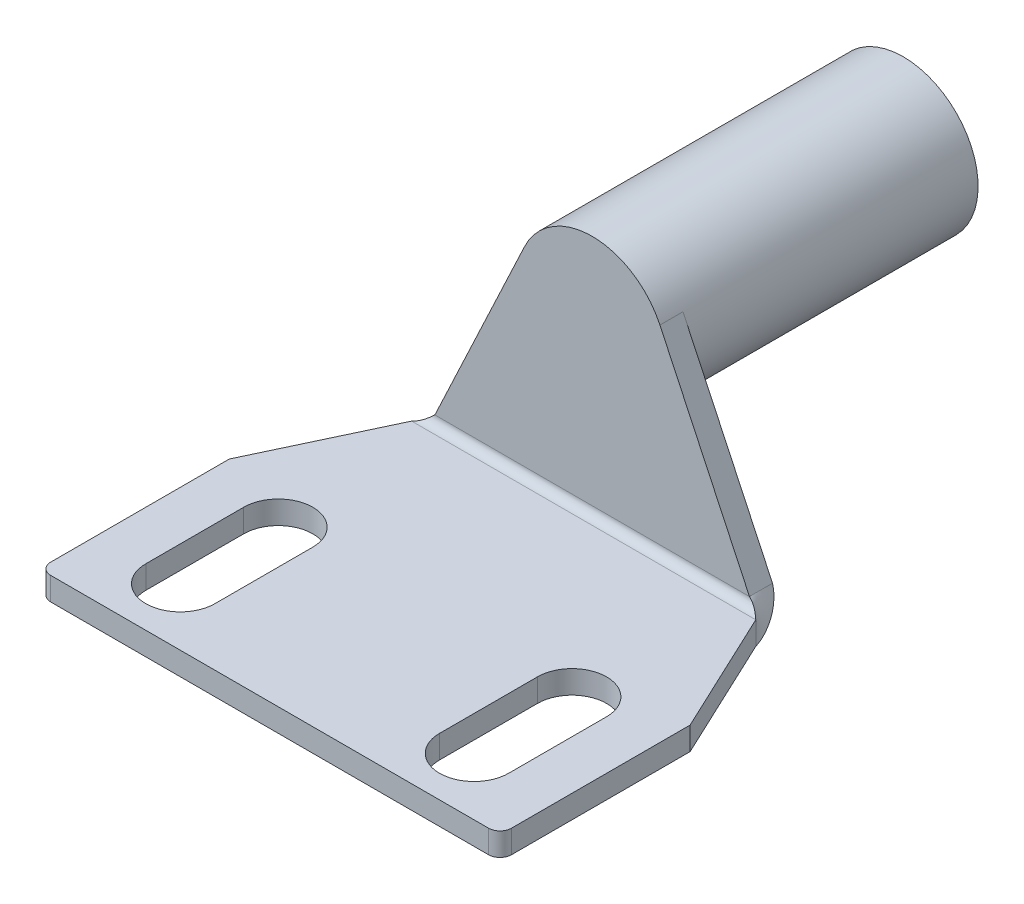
ISO-10303-21;
HEADER;
FILE_DESCRIPTION(('STEP AP214'),'2;1');
FILE_NAME('part.step','',(''),(''),'','','');
FILE_SCHEMA(('AUTOMOTIVE_DESIGN { 1 0 10303 214 1 1 1 1 }'));
ENDSEC;
DATA;
#1=APPLICATION_CONTEXT('core data for automotive mechanical design processes');
#2=APPLICATION_PROTOCOL_DEFINITION('international standard','automotive_design',2000,#1);
#3=PRODUCT_CONTEXT('',#1,'mechanical');
#4=PRODUCT('Part','Part','',(#3));
#5=PRODUCT_RELATED_PRODUCT_CATEGORY('part','',(#4));
#6=PRODUCT_DEFINITION_FORMATION('','',#4);
#7=PRODUCT_DEFINITION_CONTEXT('part definition',#1,'design');
#8=PRODUCT_DEFINITION('design','',#6,#7);
#9=PRODUCT_DEFINITION_SHAPE('','',#8);
#10=(LENGTH_UNIT() NAMED_UNIT(*) SI_UNIT(.MILLI.,.METRE.));
#11=(NAMED_UNIT(*) PLANE_ANGLE_UNIT() SI_UNIT($,.RADIAN.));
#12=(NAMED_UNIT(*) SI_UNIT($,.STERADIAN.) SOLID_ANGLE_UNIT());
#13=UNCERTAINTY_MEASURE_WITH_UNIT(LENGTH_MEASURE(1.E-05),#10,'distance_accuracy_value','');
#14=(GEOMETRIC_REPRESENTATION_CONTEXT(3) GLOBAL_UNCERTAINTY_ASSIGNED_CONTEXT((#13)) GLOBAL_UNIT_ASSIGNED_CONTEXT((#10,
#11,#12)) REPRESENTATION_CONTEXT('',''));
#15=CARTESIAN_POINT('',(0.,0.,0.));
#16=DIRECTION('',(0.,0.,1.));
#17=DIRECTION('',(1.,0.,0.));
#18=AXIS2_PLACEMENT_3D('',#15,#16,#17);
#19=CARTESIAN_POINT('',(-20.,-2.,0.));
#20=DIRECTION('',(-1.,0.,0.));
#21=DIRECTION('',(0.,0.,1.));
#22=AXIS2_PLACEMENT_3D('',#19,#20,#21);
#23=PLANE('',#22);
#24=DIRECTION('',(0.,0.,1.));
#25=VECTOR('',#24,1.);
#26=CARTESIAN_POINT('',(-20.,-2.,0.));
#27=LINE('',#26,#25);
#28=CARTESIAN_POINT('',(-20.,-2.,-18.5));
#29=VERTEX_POINT('',#28);
#30=CARTESIAN_POINT('',(-20.,-2.,-3.));
#31=VERTEX_POINT('',#30);
#32=EDGE_CURVE('E426',#29,#31,#27,.T.);
#33=ORIENTED_EDGE('',*,*,#32,.T.);
#34=DIRECTION('',(0.,1.,0.));
#35=VECTOR('',#34,1.);
#36=CARTESIAN_POINT('',(-20.,-2.,-3.));
#37=LINE('',#36,#35);
#38=CARTESIAN_POINT('',(-20.,0.,-3.));
#39=VERTEX_POINT('',#38);
#40=EDGE_CURVE('E552',#31,#39,#37,.T.);
#41=ORIENTED_EDGE('',*,*,#40,.T.);
#42=DIRECTION('',(0.,0.,1.));
#43=VECTOR('',#42,1.);
#44=CARTESIAN_POINT('',(-20.,0.,0.));
#45=LINE('',#44,#43);
#46=CARTESIAN_POINT('',(-20.,0.,-18.5));
#47=VERTEX_POINT('',#46);
#48=EDGE_CURVE('E416',#47,#39,#45,.T.);
#49=ORIENTED_EDGE('',*,*,#48,.F.);
#50=DIRECTION('',(0.,1.,0.));
#51=VECTOR('',#50,1.);
#52=CARTESIAN_POINT('',(-20.,-2.,-18.5));
#53=LINE('',#52,#51);
#54=EDGE_CURVE('E404',#29,#47,#53,.T.);
#55=ORIENTED_EDGE('',*,*,#54,.F.);
#56=EDGE_LOOP('',(#33,#41,#49,#55));
#57=FACE_BOUND('',#56,.T.);
#58=ADVANCED_FACE('F69',(#57),#23,.T.);
#59=CARTESIAN_POINT('',(20.,-2.,0.));
#60=DIRECTION('',(1.,0.,0.));
#61=DIRECTION('',(0.,0.,-1.));
#62=AXIS2_PLACEMENT_3D('',#59,#60,#61);
#63=PLANE('',#62);
#64=DIRECTION('',(0.,0.,-1.));
#65=VECTOR('',#64,1.);
#66=CARTESIAN_POINT('',(20.,0.,0.));
#67=LINE('',#66,#65);
#68=CARTESIAN_POINT('',(20.,0.,-3.));
#69=VERTEX_POINT('',#68);
#70=CARTESIAN_POINT('',(20.,0.,-18.5));
#71=VERTEX_POINT('',#70);
#72=EDGE_CURVE('E414',#69,#71,#67,.T.);
#73=ORIENTED_EDGE('',*,*,#72,.F.);
#74=DIRECTION('',(0.,-1.,0.));
#75=VECTOR('',#74,1.);
#76=CARTESIAN_POINT('',(20.,-2.,-3.));
#77=LINE('',#76,#75);
#78=CARTESIAN_POINT('',(20.,-2.,-3.));
#79=VERTEX_POINT('',#78);
#80=EDGE_CURVE('E12',#69,#79,#77,.T.);
#81=ORIENTED_EDGE('',*,*,#80,.T.);
#82=DIRECTION('',(0.,0.,-1.));
#83=VECTOR('',#82,1.);
#84=CARTESIAN_POINT('',(20.,-2.,0.));
#85=LINE('',#84,#83);
#86=CARTESIAN_POINT('',(20.,-2.,-18.5));
#87=VERTEX_POINT('',#86);
#88=EDGE_CURVE('E424',#79,#87,#85,.T.);
#89=ORIENTED_EDGE('',*,*,#88,.T.);
#90=DIRECTION('',(0.,1.,0.));
#91=VECTOR('',#90,1.);
#92=CARTESIAN_POINT('',(20.,-2.,-18.5));
#93=LINE('',#92,#91);
#94=EDGE_CURVE('E420',#87,#71,#93,.T.);
#95=ORIENTED_EDGE('',*,*,#94,.T.);
#96=EDGE_LOOP('',(#73,#81,#89,#95));
#97=FACE_BOUND('',#96,.T.);
#98=ADVANCED_FACE('F578',(#97),#63,.T.);
#99=CARTESIAN_POINT('',(0.,-2.,-45.75));
#100=DIRECTION('',(0.,1.,0.));
#101=DIRECTION('',(0.,0.,1.));
#102=AXIS2_PLACEMENT_3D('',#99,#100,#101);
#103=PLANE('',#102);
#104=DIRECTION('',(0.,0.,1.));
#105=VECTOR('',#104,1.);
#106=CARTESIAN_POINT('',(-15.75,-2.,-45.75));
#107=LINE('',#106,#105);
#108=CARTESIAN_POINT('',(-15.75,-2.,-15.5));
#109=VERTEX_POINT('',#108);
#110=CARTESIAN_POINT('',(-15.75,-2.,-7.));
#111=VERTEX_POINT('',#110);
#112=EDGE_CURVE('E268',#109,#111,#107,.T.);
#113=ORIENTED_EDGE('',*,*,#112,.T.);
#114=CARTESIAN_POINT('',(-12.75,-2.,-7.));
#115=DIRECTION('',(0.,1.,0.));
#116=DIRECTION('',(0.,0.,1.));
#117=AXIS2_PLACEMENT_3D('',#114,#115,#116);
#118=CIRCLE('',#117,3.);
#119=CARTESIAN_POINT('',(-9.75,-2.,-7.));
#120=VERTEX_POINT('',#119);
#121=EDGE_CURVE('E271',#111,#120,#118,.T.);
#122=ORIENTED_EDGE('',*,*,#121,.T.);
#123=DIRECTION('',(0.,0.,-1.));
#124=VECTOR('',#123,1.);
#125=CARTESIAN_POINT('',(-9.74999999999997,-2.,-45.75));
#126=LINE('',#125,#124);
#127=CARTESIAN_POINT('',(-9.74999999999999,-2.,-15.5));
#128=VERTEX_POINT('',#127);
#129=EDGE_CURVE('E239',#120,#128,#126,.T.);
#130=ORIENTED_EDGE('',*,*,#129,.T.);
#131=CARTESIAN_POINT('',(-12.75,-2.,-15.5));
#132=DIRECTION('',(0.,1.,0.));
#133=DIRECTION('',(0.,0.,1.));
#134=AXIS2_PLACEMENT_3D('',#131,#132,#133);
#135=CIRCLE('',#134,3.);
#136=EDGE_CURVE('E265',#128,#109,#135,.T.);
#137=ORIENTED_EDGE('',*,*,#136,.T.);
#138=EDGE_LOOP('',(#113,#122,#130,#137));
#139=FACE_BOUND('',#138,.T.);
#140=DIRECTION('',(0.,0.,1.));
#141=VECTOR('',#140,1.);
#142=CARTESIAN_POINT('',(9.74999999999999,-2.,-45.75));
#143=LINE('',#142,#141);
#144=CARTESIAN_POINT('',(9.75,-2.,-15.5));
#145=VERTEX_POINT('',#144);
#146=CARTESIAN_POINT('',(9.75,-2.,-7.));
#147=VERTEX_POINT('',#146);
#148=EDGE_CURVE('E277',#145,#147,#143,.T.);
#149=ORIENTED_EDGE('',*,*,#148,.T.);
#150=CARTESIAN_POINT('',(12.75,-2.,-7.));
#151=DIRECTION('',(0.,1.,0.));
#152=DIRECTION('',(0.,0.,1.));
#153=AXIS2_PLACEMENT_3D('',#150,#151,#152);
#154=CIRCLE('',#153,3.);
#155=CARTESIAN_POINT('',(15.75,-2.,-7.));
#156=VERTEX_POINT('',#155);
#157=EDGE_CURVE('E280',#147,#156,#154,.T.);
#158=ORIENTED_EDGE('',*,*,#157,.T.);
#159=DIRECTION('',(0.,0.,-1.));
#160=VECTOR('',#159,1.);
#161=CARTESIAN_POINT('',(15.75,-2.,-45.75));
#162=LINE('',#161,#160);
#163=CARTESIAN_POINT('',(15.75,-2.,-15.5));
#164=VERTEX_POINT('',#163);
#165=EDGE_CURVE('E274',#156,#164,#162,.T.);
#166=ORIENTED_EDGE('',*,*,#165,.T.);
#167=CARTESIAN_POINT('',(12.75,-2.,-15.5));
#168=DIRECTION('',(0.,1.,0.));
#169=DIRECTION('',(0.,0.,1.));
#170=AXIS2_PLACEMENT_3D('',#167,#168,#169);
#171=CIRCLE('',#170,3.);
#172=EDGE_CURVE('E214',#164,#145,#171,.T.);
#173=ORIENTED_EDGE('',*,*,#172,.T.);
#174=EDGE_LOOP('',(#149,#158,#166,#173));
#175=FACE_BOUND('',#174,.T.);
#176=DIRECTION('',(1.,0.,0.));
#177=VECTOR('',#176,1.);
#178=CARTESIAN_POINT('',(0.,-2.,-2.));
#179=LINE('',#178,#177);
#180=CARTESIAN_POINT('',(-19.,-2.,-2.));
#181=VERTEX_POINT('',#180);
#182=CARTESIAN_POINT('',(19.,-2.,-2.));
#183=VERTEX_POINT('',#182);
#184=EDGE_CURVE('E245',#181,#183,#179,.T.);
#185=ORIENTED_EDGE('',*,*,#184,.F.);
#186=CARTESIAN_POINT('',(-19.,-2.,-3.));
#187=DIRECTION('',(0.,1.,0.));
#188=DIRECTION('',(0.,0.,1.));
#189=AXIS2_PLACEMENT_3D('',#186,#187,#188);
#190=CIRCLE('',#189,1.);
#191=EDGE_CURVE('E77',#181,#31,#190,.F.);
#192=ORIENTED_EDGE('',*,*,#191,.T.);
#193=ORIENTED_EDGE('',*,*,#32,.F.);
#194=DIRECTION('',(-0.42561713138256,0.,0.904903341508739));
#195=VECTOR('',#194,1.);
#196=CARTESIAN_POINT('',(-20.,-2.,-18.5));
#197=LINE('',#196,#195);
#198=CARTESIAN_POINT('',(-14.9374842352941,-2.,-29.2634));
#199=VERTEX_POINT('',#198);
#200=EDGE_CURVE('E413',#199,#29,#197,.T.);
#201=ORIENTED_EDGE('',*,*,#200,.F.);
#202=DIRECTION('',(-1.,0.,0.));
#203=VECTOR('',#202,1.);
#204=CARTESIAN_POINT('',(0.,-2.,-29.2634));
#205=LINE('',#204,#203);
#206=CARTESIAN_POINT('',(14.9374842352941,-2.,-29.2634));
#207=VERTEX_POINT('',#206);
#208=EDGE_CURVE('E429',#207,#199,#205,.T.);
#209=ORIENTED_EDGE('',*,*,#208,.F.);
#210=DIRECTION('',(-0.42561713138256,0.,-0.904903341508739));
#211=VECTOR('',#210,1.);
#212=CARTESIAN_POINT('',(20.,-2.,-18.5));
#213=LINE('',#212,#211);
#214=EDGE_CURVE('E423',#87,#207,#213,.T.);
#215=ORIENTED_EDGE('',*,*,#214,.F.);
#216=ORIENTED_EDGE('',*,*,#88,.F.);
#217=CARTESIAN_POINT('',(19.,-2.,-3.));
#218=DIRECTION('',(0.,1.,0.));
#219=DIRECTION('',(0.,0.,1.));
#220=AXIS2_PLACEMENT_3D('',#217,#218,#219);
#221=CIRCLE('',#220,1.);
#222=EDGE_CURVE('E84',#79,#183,#221,.F.);
#223=ORIENTED_EDGE('',*,*,#222,.T.);
#224=EDGE_LOOP('',(#185,#192,#193,#201,#209,#215,#216,#223));
#225=FACE_BOUND('',#224,.T.);
#226=ADVANCED_FACE('F463',(#139,#175,#225),#103,.F.);
#227=CARTESIAN_POINT('',(0.,0.,-45.75));
#228=DIRECTION('',(0.,1.,0.));
#229=DIRECTION('',(0.,0.,1.));
#230=AXIS2_PLACEMENT_3D('',#227,#228,#229);
#231=PLANE('',#230);
#232=CARTESIAN_POINT('',(12.75,0.,-7.));
#233=DIRECTION('',(0.,1.,0.));
#234=DIRECTION('',(0.,0.,1.));
#235=AXIS2_PLACEMENT_3D('',#232,#233,#234);
#236=CIRCLE('',#235,3.);
#237=CARTESIAN_POINT('',(9.75,0.,-7.));
#238=VERTEX_POINT('',#237);
#239=CARTESIAN_POINT('',(15.75,0.,-7.));
#240=VERTEX_POINT('',#239);
#241=EDGE_CURVE('E227',#238,#240,#236,.T.);
#242=ORIENTED_EDGE('',*,*,#241,.F.);
#243=DIRECTION('',(0.,0.,1.));
#244=VECTOR('',#243,1.);
#245=CARTESIAN_POINT('',(9.75,0.,-7.));
#246=LINE('',#245,#244);
#247=CARTESIAN_POINT('',(9.75,0.,-15.5));
#248=VERTEX_POINT('',#247);
#249=EDGE_CURVE('E232',#248,#238,#246,.T.);
#250=ORIENTED_EDGE('',*,*,#249,.F.);
#251=CARTESIAN_POINT('',(12.75,0.,-15.5));
#252=DIRECTION('',(0.,1.,0.));
#253=DIRECTION('',(0.,0.,1.));
#254=AXIS2_PLACEMENT_3D('',#251,#252,#253);
#255=CIRCLE('',#254,3.);
#256=CARTESIAN_POINT('',(15.75,0.,-15.5));
#257=VERTEX_POINT('',#256);
#258=EDGE_CURVE('E211',#257,#248,#255,.T.);
#259=ORIENTED_EDGE('',*,*,#258,.F.);
#260=DIRECTION('',(0.,0.,-1.));
#261=VECTOR('',#260,1.);
#262=CARTESIAN_POINT('',(15.75,0.,-7.));
#263=LINE('',#262,#261);
#264=EDGE_CURVE('E222',#240,#257,#263,.T.);
#265=ORIENTED_EDGE('',*,*,#264,.F.);
#266=EDGE_LOOP('',(#242,#250,#259,#265));
#267=FACE_BOUND('',#266,.T.);
#268=CARTESIAN_POINT('',(-12.75,0.,-7.));
#269=DIRECTION('',(0.,1.,0.));
#270=DIRECTION('',(0.,0.,-1.));
#271=AXIS2_PLACEMENT_3D('',#268,#269,#270);
#272=CIRCLE('',#271,3.);
#273=CARTESIAN_POINT('',(-15.75,0.,-7.));
#274=VERTEX_POINT('',#273);
#275=CARTESIAN_POINT('',(-9.75,0.,-7.00000000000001));
#276=VERTEX_POINT('',#275);
#277=EDGE_CURVE('E242',#274,#276,#272,.T.);
#278=ORIENTED_EDGE('',*,*,#277,.F.);
#279=DIRECTION('',(0.,0.,1.));
#280=VECTOR('',#279,1.);
#281=CARTESIAN_POINT('',(-15.75,0.,-7.));
#282=LINE('',#281,#280);
#283=CARTESIAN_POINT('',(-15.75,0.,-15.5));
#284=VERTEX_POINT('',#283);
#285=EDGE_CURVE('E251',#284,#274,#282,.T.);
#286=ORIENTED_EDGE('',*,*,#285,.F.);
#287=CARTESIAN_POINT('',(-12.75,0.,-15.5));
#288=DIRECTION('',(0.,1.,0.));
#289=DIRECTION('',(0.,0.,-1.));
#290=AXIS2_PLACEMENT_3D('',#287,#288,#289);
#291=CIRCLE('',#290,3.);
#292=CARTESIAN_POINT('',(-9.74999999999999,0.,-15.5));
#293=VERTEX_POINT('',#292);
#294=EDGE_CURVE('E248',#293,#284,#291,.T.);
#295=ORIENTED_EDGE('',*,*,#294,.F.);
#296=DIRECTION('',(0.,0.,-1.));
#297=VECTOR('',#296,1.);
#298=CARTESIAN_POINT('',(-9.75,0.,-7.));
#299=LINE('',#298,#297);
#300=EDGE_CURVE('E244',#276,#293,#299,.T.);
#301=ORIENTED_EDGE('',*,*,#300,.F.);
#302=EDGE_LOOP('',(#278,#286,#295,#301));
#303=FACE_BOUND('',#302,.T.);
#304=ORIENTED_EDGE('',*,*,#48,.T.);
#305=CARTESIAN_POINT('',(-19.,0.,-3.));
#306=DIRECTION('',(0.,1.,0.));
#307=DIRECTION('',(0.,0.,1.));
#308=AXIS2_PLACEMENT_3D('',#305,#306,#307);
#309=CIRCLE('',#308,1.);
#310=CARTESIAN_POINT('',(-19.,0.,-2.));
#311=VERTEX_POINT('',#310);
#312=EDGE_CURVE('E557',#39,#311,#309,.T.);
#313=ORIENTED_EDGE('',*,*,#312,.T.);
#314=DIRECTION('',(1.,0.,0.));
#315=VECTOR('',#314,1.);
#316=CARTESIAN_POINT('',(0.,0.,-2.));
#317=LINE('',#316,#315);
#318=CARTESIAN_POINT('',(19.,0.,-2.));
#319=VERTEX_POINT('',#318);
#320=EDGE_CURVE('E290',#311,#319,#317,.T.);
#321=ORIENTED_EDGE('',*,*,#320,.T.);
#322=CARTESIAN_POINT('',(19.,0.,-3.));
#323=DIRECTION('',(0.,1.,0.));
#324=DIRECTION('',(0.,0.,1.));
#325=AXIS2_PLACEMENT_3D('',#322,#323,#324);
#326=CIRCLE('',#325,1.);
#327=EDGE_CURVE('E555',#319,#69,#326,.T.);
#328=ORIENTED_EDGE('',*,*,#327,.T.);
#329=ORIENTED_EDGE('',*,*,#72,.T.);
#330=DIRECTION('',(-0.42561713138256,0.,-0.904903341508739));
#331=VECTOR('',#330,1.);
#332=CARTESIAN_POINT('',(20.,0.,-18.5));
#333=LINE('',#332,#331);
#334=CARTESIAN_POINT('',(14.9374842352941,0.,-29.2634));
#335=VERTEX_POINT('',#334);
#336=EDGE_CURVE('E433',#71,#335,#333,.T.);
#337=ORIENTED_EDGE('',*,*,#336,.T.);
#338=DIRECTION('',(-1.,0.,0.));
#339=VECTOR('',#338,1.);
#340=CARTESIAN_POINT('',(0.,0.,-29.2634));
#341=LINE('',#340,#339);
#342=CARTESIAN_POINT('',(-14.9374842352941,0.,-29.2634));
#343=VERTEX_POINT('',#342);
#344=EDGE_CURVE('E430',#335,#343,#341,.T.);
#345=ORIENTED_EDGE('',*,*,#344,.T.);
#346=DIRECTION('',(-0.42561713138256,0.,0.904903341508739));
#347=VECTOR('',#346,1.);
#348=CARTESIAN_POINT('',(-20.,0.,-18.5));
#349=LINE('',#348,#347);
#350=EDGE_CURVE('E419',#343,#47,#349,.T.);
#351=ORIENTED_EDGE('',*,*,#350,.T.);
#352=EDGE_LOOP('',(#304,#313,#321,#328,#329,#337,#345,#351));
#353=FACE_BOUND('',#352,.T.);
#354=ADVANCED_FACE('F229',(#267,#303,#353),#231,.T.);
#355=CARTESIAN_POINT('',(0.,14.495355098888,-32.));
#356=DIRECTION('',(0.,0.,1.));
#357=DIRECTION('',(0.,-1.,0.));
#358=AXIS2_PLACEMENT_3D('',#355,#356,#357);
#359=PLANE('',#358);
#360=CARTESIAN_POINT('',(0.,14.495355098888,-32.));
#361=DIRECTION('',(0.,0.,-1.));
#362=DIRECTION('',(0.,1.,0.));
#363=AXIS2_PLACEMENT_3D('',#360,#361,#362);
#364=CIRCLE('',#363,6.5);
#365=CARTESIAN_POINT('',(5.88187171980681,17.2618664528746,-32.));
#366=VERTEX_POINT('',#365);
#367=CARTESIAN_POINT('',(-5.8818717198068,17.2618664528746,-32.));
#368=VERTEX_POINT('',#367);
#369=EDGE_CURVE('E286',#366,#368,#364,.T.);
#370=ORIENTED_EDGE('',*,*,#369,.F.);
#371=DIRECTION('',(-0.42561713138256,0.904903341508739,0.));
#372=VECTOR('',#371,1.);
#373=CARTESIAN_POINT('',(20.,-12.754644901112,-32.0000000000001));
#374=LINE('',#373,#372);
#375=CARTESIAN_POINT('',(13.6544549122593,0.736600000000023,-32.));
#376=VERTEX_POINT('',#375);
#377=EDGE_CURVE('E505',#376,#366,#374,.T.);
#378=ORIENTED_EDGE('',*,*,#377,.F.);
#379=DIRECTION('',(-1.,0.,0.));
#380=VECTOR('',#379,1.);
#381=CARTESIAN_POINT('',(0.,0.736600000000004,-32.));
#382=LINE('',#381,#380);
#383=CARTESIAN_POINT('',(-13.6544549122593,0.736600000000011,-32.));
#384=VERTEX_POINT('',#383);
#385=EDGE_CURVE('E493',#376,#384,#382,.T.);
#386=ORIENTED_EDGE('',*,*,#385,.T.);
#387=DIRECTION('',(-0.42561713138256,-0.904903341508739,0.));
#388=VECTOR('',#387,1.);
#389=CARTESIAN_POINT('',(-20.,-12.754644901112,-32.0000000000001));
#390=LINE('',#389,#388);
#391=EDGE_CURVE('E497',#368,#384,#390,.T.);
#392=ORIENTED_EDGE('',*,*,#391,.F.);
#393=EDGE_LOOP('',(#370,#378,#386,#392));
#394=FACE_BOUND('',#393,.T.);
#395=ADVANCED_FACE('F466',(#394),#359,.F.);
#396=CARTESIAN_POINT('',(-20.,-12.754644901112,-32.0000000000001));
#397=DIRECTION('',(-0.904903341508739,0.42561713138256,0.));
#398=DIRECTION('',(-0.42561713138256,-0.904903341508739,0.));
#399=AXIS2_PLACEMENT_3D('',#396,#397,#398);
#400=PLANE('',#399);
#401=CARTESIAN_POINT('',(-13.6544549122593,0.7366,-30.));
#402=CARTESIAN_POINT('',(-13.6544549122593,0.736599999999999,-32.));
#403=B_SPLINE_CURVE_WITH_KNOTS('',1,(#401,#402),.UNSPECIFIED.,.F.,.F.,(2,2),(0.,1.),.UNSPECIFIED.);
#404=CARTESIAN_POINT('',(-13.6544549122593,0.736600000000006,-30.));
#405=VERTEX_POINT('',#404);
#406=EDGE_CURVE('E291',#405,#384,#403,.T.);
#407=ORIENTED_EDGE('',*,*,#406,.F.);
#408=DIRECTION('',(-0.42561713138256,-0.904903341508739,0.));
#409=VECTOR('',#408,1.);
#410=CARTESIAN_POINT('',(-20.,-12.754644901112,-30.0000000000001));
#411=LINE('',#410,#409);
#412=CARTESIAN_POINT('',(-5.8818717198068,17.2618664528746,-30.));
#413=VERTEX_POINT('',#412);
#414=EDGE_CURVE('E490',#413,#405,#411,.T.);
#415=ORIENTED_EDGE('',*,*,#414,.F.);
#416=DIRECTION('',(0.,0.,1.));
#417=VECTOR('',#416,1.);
#418=CARTESIAN_POINT('',(-5.8818717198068,17.2618664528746,-32.));
#419=LINE('',#418,#417);
#420=EDGE_CURVE('E491',#368,#413,#419,.T.);
#421=ORIENTED_EDGE('',*,*,#420,.F.);
#422=ORIENTED_EDGE('',*,*,#391,.T.);
#423=EDGE_LOOP('',(#407,#415,#421,#422));
#424=FACE_BOUND('',#423,.T.);
#425=ADVANCED_FACE('F533',(#424),#400,.T.);
#426=CARTESIAN_POINT('',(0.,14.495355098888,-32.));
#427=DIRECTION('',(0.,0.,1.));
#428=DIRECTION('',(0.,-1.,0.));
#429=AXIS2_PLACEMENT_3D('',#426,#427,#428);
#430=CYLINDRICAL_SURFACE('',#429,6.50000000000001);
#431=CARTESIAN_POINT('',(0.,14.495355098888,-30.));
#432=DIRECTION('',(0.,0.,1.));
#433=DIRECTION('',(0.,-1.,0.));
#434=AXIS2_PLACEMENT_3D('',#431,#432,#433);
#435=CIRCLE('',#434,6.50000000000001);
#436=CARTESIAN_POINT('',(5.8818717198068,17.2618664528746,-30.));
#437=VERTEX_POINT('',#436);
#438=EDGE_CURVE('E487',#437,#413,#435,.T.);
#439=ORIENTED_EDGE('',*,*,#438,.F.);
#440=DIRECTION('',(0.,0.,1.));
#441=VECTOR('',#440,1.);
#442=CARTESIAN_POINT('',(5.8818717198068,17.2618664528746,-32.));
#443=LINE('',#442,#441);
#444=EDGE_CURVE('E494',#366,#437,#443,.T.);
#445=ORIENTED_EDGE('',*,*,#444,.F.);
#446=ORIENTED_EDGE('',*,*,#369,.T.);
#447=ORIENTED_EDGE('',*,*,#420,.T.);
#448=EDGE_LOOP('',(#439,#445,#446,#447));
#449=FACE_BOUND('',#448,.T.);
#450=CARTESIAN_POINT('',(0.,14.4953550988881,-57.));
#451=DIRECTION('',(0.,0.,-1.));
#452=DIRECTION('',(0.,1.,0.));
#453=AXIS2_PLACEMENT_3D('',#450,#451,#452);
#454=CIRCLE('',#453,6.5);
#455=CARTESIAN_POINT('',(0.,20.9953550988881,-56.9999999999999));
#456=VERTEX_POINT('',#455);
#457=EDGE_CURVE('E292',#456,#456,#454,.T.);
#458=ORIENTED_EDGE('',*,*,#457,.F.);
#459=EDGE_LOOP('',(#458));
#460=FACE_BOUND('',#459,.T.);
#461=ADVANCED_FACE('F471',(#449,#460),#430,.T.);
#462=CARTESIAN_POINT('',(20.,-12.754644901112,-32.0000000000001));
#463=DIRECTION('',(0.904903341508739,0.42561713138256,0.));
#464=DIRECTION('',(-0.42561713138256,0.904903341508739,0.));
#465=AXIS2_PLACEMENT_3D('',#462,#463,#464);
#466=PLANE('',#465);
#467=CARTESIAN_POINT('',(13.6544549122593,0.736599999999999,-32.));
#468=CARTESIAN_POINT('',(13.6544549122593,0.7366,-30.));
#469=B_SPLINE_CURVE_WITH_KNOTS('',1,(#467,#468),.UNSPECIFIED.,.F.,.F.,(2,2),(0.,1.),.UNSPECIFIED.);
#470=CARTESIAN_POINT('',(13.6544549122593,0.736600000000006,-30.));
#471=VERTEX_POINT('',#470);
#472=EDGE_CURVE('E500',#376,#471,#469,.T.);
#473=ORIENTED_EDGE('',*,*,#472,.F.);
#474=ORIENTED_EDGE('',*,*,#377,.T.);
#475=ORIENTED_EDGE('',*,*,#444,.T.);
#476=DIRECTION('',(-0.42561713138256,0.904903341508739,0.));
#477=VECTOR('',#476,1.);
#478=CARTESIAN_POINT('',(20.,-12.754644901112,-30.0000000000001));
#479=LINE('',#478,#477);
#480=EDGE_CURVE('E412',#471,#437,#479,.T.);
#481=ORIENTED_EDGE('',*,*,#480,.F.);
#482=EDGE_LOOP('',(#473,#474,#475,#481));
#483=FACE_BOUND('',#482,.T.);
#484=ADVANCED_FACE('F521',(#483),#466,.T.);
#485=CARTESIAN_POINT('',(0.,14.495355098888,-30.));
#486=DIRECTION('',(0.,0.,1.));
#487=DIRECTION('',(0.,-1.,0.));
#488=AXIS2_PLACEMENT_3D('',#485,#486,#487);
#489=PLANE('',#488);
#490=DIRECTION('',(-1.,0.,0.));
#491=VECTOR('',#490,1.);
#492=CARTESIAN_POINT('',(0.,0.736599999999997,-30.));
#493=LINE('',#492,#491);
#494=EDGE_CURVE('E583',#471,#405,#493,.T.);
#495=ORIENTED_EDGE('',*,*,#494,.F.);
#496=ORIENTED_EDGE('',*,*,#480,.T.);
#497=ORIENTED_EDGE('',*,*,#438,.T.);
#498=ORIENTED_EDGE('',*,*,#414,.T.);
#499=EDGE_LOOP('',(#495,#496,#497,#498));
#500=FACE_BOUND('',#499,.T.);
#501=ADVANCED_FACE('F462',(#500),#489,.T.);
#502=CARTESIAN_POINT('',(20.,-2.,-18.5));
#503=DIRECTION('',(0.904903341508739,0.,-0.42561713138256));
#504=DIRECTION('',(-0.42561713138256,0.,-0.904903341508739));
#505=AXIS2_PLACEMENT_3D('',#502,#503,#504);
#506=PLANE('',#505);
#507=ORIENTED_EDGE('',*,*,#214,.T.);
#508=CARTESIAN_POINT('',(14.9374842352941,0.,-29.2634));
#509=CARTESIAN_POINT('',(14.9374842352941,-2.,-29.2634));
#510=B_SPLINE_CURVE_WITH_KNOTS('',1,(#508,#509),.UNSPECIFIED.,.F.,.F.,(2,2),(0.,1.),.UNSPECIFIED.);
#511=EDGE_CURVE('E438',#207,#335,#510,.F.);
#512=ORIENTED_EDGE('',*,*,#511,.T.);
#513=ORIENTED_EDGE('',*,*,#336,.F.);
#514=ORIENTED_EDGE('',*,*,#94,.F.);
#515=EDGE_LOOP('',(#507,#512,#513,#514));
#516=FACE_BOUND('',#515,.T.);
#517=ADVANCED_FACE('F451',(#516),#506,.T.);
#518=CARTESIAN_POINT('',(-20.,-2.,-18.5));
#519=DIRECTION('',(-0.904903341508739,0.,-0.42561713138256));
#520=DIRECTION('',(-0.42561713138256,0.,0.904903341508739));
#521=AXIS2_PLACEMENT_3D('',#518,#519,#520);
#522=PLANE('',#521);
#523=ORIENTED_EDGE('',*,*,#350,.F.);
#524=CARTESIAN_POINT('',(-14.9374842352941,-2.,-29.2634));
#525=CARTESIAN_POINT('',(-14.9374842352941,0.,-29.2634));
#526=B_SPLINE_CURVE_WITH_KNOTS('',1,(#524,#525),.UNSPECIFIED.,.F.,.F.,(2,2),(0.,1.),.UNSPECIFIED.);
#527=EDGE_CURVE('E400',#343,#199,#526,.F.);
#528=ORIENTED_EDGE('',*,*,#527,.T.);
#529=ORIENTED_EDGE('',*,*,#200,.T.);
#530=ORIENTED_EDGE('',*,*,#54,.T.);
#531=EDGE_LOOP('',(#523,#528,#529,#530));
#532=FACE_BOUND('',#531,.T.);
#533=ADVANCED_FACE('F461',(#532),#522,.T.);
#534=CARTESIAN_POINT('',(13.6544549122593,0.736599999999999,-32.));
#535=CARTESIAN_POINT('',(13.7613917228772,0.378320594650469,-32.));
#536=CARTESIAN_POINT('',(13.8682931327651,0.0203007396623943,-31.9287736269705));
#537=CARTESIAN_POINT('',(14.0821313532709,-0.641603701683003,-31.6546038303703));
#538=CARTESIAN_POINT('',(14.1890504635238,-0.945168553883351,-31.4517682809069));
#539=CARTESIAN_POINT('',(14.4028886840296,-1.45176828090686,-30.9451685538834));
#540=CARTESIAN_POINT('',(14.5098077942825,-1.65460383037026,-30.641603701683));
#541=CARTESIAN_POINT('',(14.7236460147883,-1.92877362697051,-29.9796992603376));
#542=CARTESIAN_POINT('',(14.8305474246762,-2.,-29.6216794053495));
#543=CARTESIAN_POINT('',(14.9374842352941,-2.,-29.2634));
#544=CARTESIAN_POINT('',(13.6544549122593,0.7366,-30.));
#545=CARTESIAN_POINT('',(13.7613826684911,0.64017148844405,-30.));
#546=CARTESIAN_POINT('',(13.8682931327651,0.543796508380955,-29.9808282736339));
#547=CARTESIAN_POINT('',(14.0821313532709,0.365634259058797,-29.9070310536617));
#548=CARTESIAN_POINT('',(14.1890504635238,0.283924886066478,-29.8524345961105));
#549=CARTESIAN_POINT('',(14.4028886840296,0.147565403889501,-29.7160751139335));
#550=CARTESIAN_POINT('',(14.5098077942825,0.0929689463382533,-29.6343657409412));
#551=CARTESIAN_POINT('',(14.7236460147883,0.0191717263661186,-29.456203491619));
#552=CARTESIAN_POINT('',(14.8305564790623,0.,-29.3598285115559));
#553=CARTESIAN_POINT('',(14.9374842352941,0.,-29.2634));
#554=B_SPLINE_SURFACE_WITH_KNOTS('',1,3,((#534,#535,#536,#537,#538,#539,#540,#541,#542,#543),
(#544,#545,#546,#547,#548,#549,#550,#551,#552,#553)),.UNSPECIFIED.,.F.,.F.,.F.,(2,2),(4,2,2,2,
4),(0.,1.),(0.,0.25,0.5,0.75,1.),.UNSPECIFIED.);
#555=CARTESIAN_POINT('',(13.6544549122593,0.7366,-30.));
#556=CARTESIAN_POINT('',(13.7613826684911,0.64017148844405,-30.));
#557=CARTESIAN_POINT('',(13.8682931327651,0.543796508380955,-29.9808282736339));
#558=CARTESIAN_POINT('',(14.0821313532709,0.365634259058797,-29.9070310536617));
#559=CARTESIAN_POINT('',(14.1890504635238,0.283924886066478,-29.8524345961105));
#560=CARTESIAN_POINT('',(14.4028886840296,0.147565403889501,-29.7160751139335));
#561=CARTESIAN_POINT('',(14.5098077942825,0.0929689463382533,-29.6343657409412));
#562=CARTESIAN_POINT('',(14.7236460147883,0.0191717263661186,-29.456203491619));
#563=CARTESIAN_POINT('',(14.8305564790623,0.,-29.3598285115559));
#564=CARTESIAN_POINT('',(14.9374842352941,0.,-29.2634));
#565=B_SPLINE_CURVE_WITH_KNOTS('',3,(#555,#556,#557,#558,#559,#560,#561,#562,#563,#564),
.UNSPECIFIED.,.F.,.F.,(4,2,2,2,4),(0.,0.25,0.5,0.75,1.),.UNSPECIFIED.);
#566=EDGE_CURVE('E295',#471,#335,#565,.T.);
#567=CARTESIAN_POINT('',(14.9374842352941,-2.,-29.2634));
#568=CARTESIAN_POINT('',(14.8305474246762,-2.,-29.6216794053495));
#569=CARTESIAN_POINT('',(14.7236460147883,-1.92877362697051,-29.9796992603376));
#570=CARTESIAN_POINT('',(14.5098077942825,-1.65460383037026,-30.641603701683));
#571=CARTESIAN_POINT('',(14.4028886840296,-1.45176828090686,-30.9451685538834));
#572=CARTESIAN_POINT('',(14.1890504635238,-0.945168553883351,-31.4517682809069));
#573=CARTESIAN_POINT('',(14.0821313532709,-0.641603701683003,-31.6546038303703));
#574=CARTESIAN_POINT('',(13.8682931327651,0.0203007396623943,-31.9287736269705));
#575=CARTESIAN_POINT('',(13.7613917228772,0.378320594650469,-32.));
#576=CARTESIAN_POINT('',(13.6544549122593,0.736599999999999,-32.));
#577=B_SPLINE_CURVE_WITH_KNOTS('',3,(#567,#568,#569,#570,#571,#572,#573,#574,#575,#576),
.UNSPECIFIED.,.F.,.F.,(4,2,2,2,4),(0.,0.25,0.5,0.75,1.),.UNSPECIFIED.);
#578=EDGE_CURVE('E598',#376,#207,#577,.F.);
#579=ORIENTED_EDGE('',*,*,#472,.T.);
#580=ORIENTED_EDGE('',*,*,#566,.T.);
#581=ORIENTED_EDGE('',*,*,#511,.F.);
#582=ORIENTED_EDGE('',*,*,#578,.F.);
#583=EDGE_LOOP('',(#579,#580,#581,#582));
#584=FACE_BOUND('',#583,.T.);
#585=ADVANCED_FACE('F371',(#584),#554,.T.);
#586=CARTESIAN_POINT('',(-14.9374842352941,-2.,-29.2634));
#587=CARTESIAN_POINT('',(-14.8305474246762,-2.,-29.6216794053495));
#588=CARTESIAN_POINT('',(-14.7236460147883,-1.92877362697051,-29.9796992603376));
#589=CARTESIAN_POINT('',(-14.5098077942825,-1.65460383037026,-30.641603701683));
#590=CARTESIAN_POINT('',(-14.4028886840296,-1.45176828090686,-30.9451685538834));
#591=CARTESIAN_POINT('',(-14.1890504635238,-0.945168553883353,-31.4517682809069));
#592=CARTESIAN_POINT('',(-14.0821313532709,-0.641603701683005,-31.6546038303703));
#593=CARTESIAN_POINT('',(-13.8682931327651,0.020300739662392,-31.9287736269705));
#594=CARTESIAN_POINT('',(-13.7613917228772,0.378320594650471,-32.));
#595=CARTESIAN_POINT('',(-13.6544549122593,0.736599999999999,-32.));
#596=CARTESIAN_POINT('',(-14.9374842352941,0.,-29.2634));
#597=CARTESIAN_POINT('',(-14.8305564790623,0.,-29.3598285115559));
#598=CARTESIAN_POINT('',(-14.7236460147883,0.0191717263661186,-29.456203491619));
#599=CARTESIAN_POINT('',(-14.5098077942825,0.0929689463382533,-29.6343657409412));
#600=CARTESIAN_POINT('',(-14.4028886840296,0.1475654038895,-29.7160751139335));
#601=CARTESIAN_POINT('',(-14.1890504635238,0.283924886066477,-29.8524345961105));
#602=CARTESIAN_POINT('',(-14.0821313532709,0.365634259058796,-29.9070310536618));
#603=CARTESIAN_POINT('',(-13.8682931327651,0.543796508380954,-29.9808282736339));
#604=CARTESIAN_POINT('',(-13.7613826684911,0.640171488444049,-30.));
#605=CARTESIAN_POINT('',(-13.6544549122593,0.7366,-30.));
#606=B_SPLINE_SURFACE_WITH_KNOTS('',1,3,((#586,#587,#588,#589,#590,#591,#592,#593,#594,#595),
(#596,#597,#598,#599,#600,#601,#602,#603,#604,#605)),.UNSPECIFIED.,.F.,.F.,.F.,(2,2),(4,2,2,2,
4),(0.,1.),(0.,0.25,0.5,0.75,1.),.UNSPECIFIED.);
#607=CARTESIAN_POINT('',(-14.9374842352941,0.,-29.2634));
#608=CARTESIAN_POINT('',(-14.8305564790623,0.,-29.3598285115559));
#609=CARTESIAN_POINT('',(-14.7236460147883,0.0191717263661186,-29.456203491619));
#610=CARTESIAN_POINT('',(-14.5098077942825,0.0929689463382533,-29.6343657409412));
#611=CARTESIAN_POINT('',(-14.4028886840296,0.1475654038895,-29.7160751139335));
#612=CARTESIAN_POINT('',(-14.1890504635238,0.283924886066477,-29.8524345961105));
#613=CARTESIAN_POINT('',(-14.0821313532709,0.365634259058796,-29.9070310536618));
#614=CARTESIAN_POINT('',(-13.8682931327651,0.543796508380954,-29.9808282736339));
#615=CARTESIAN_POINT('',(-13.7613826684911,0.640171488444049,-30.));
#616=CARTESIAN_POINT('',(-13.6544549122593,0.7366,-30.));
#617=B_SPLINE_CURVE_WITH_KNOTS('',3,(#607,#608,#609,#610,#611,#612,#613,#614,#615,#616),
.UNSPECIFIED.,.F.,.F.,(4,2,2,2,4),(0.,0.25,0.5,0.75,1.),.UNSPECIFIED.);
#618=EDGE_CURVE('E343',#343,#405,#617,.T.);
#619=CARTESIAN_POINT('',(-13.6544549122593,0.736599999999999,-32.));
#620=CARTESIAN_POINT('',(-13.7613917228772,0.378320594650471,-32.));
#621=CARTESIAN_POINT('',(-13.8682931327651,0.020300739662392,-31.9287736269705));
#622=CARTESIAN_POINT('',(-14.0821313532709,-0.641603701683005,-31.6546038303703));
#623=CARTESIAN_POINT('',(-14.1890504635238,-0.945168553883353,-31.4517682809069));
#624=CARTESIAN_POINT('',(-14.4028886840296,-1.45176828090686,-30.9451685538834));
#625=CARTESIAN_POINT('',(-14.5098077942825,-1.65460383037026,-30.641603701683));
#626=CARTESIAN_POINT('',(-14.7236460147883,-1.92877362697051,-29.9796992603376));
#627=CARTESIAN_POINT('',(-14.8305474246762,-2.,-29.6216794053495));
#628=CARTESIAN_POINT('',(-14.9374842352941,-2.,-29.2634));
#629=B_SPLINE_CURVE_WITH_KNOTS('',3,(#619,#620,#621,#622,#623,#624,#625,#626,#627,#628),
.UNSPECIFIED.,.F.,.F.,(4,2,2,2,4),(0.,0.25,0.5,0.75,1.),.UNSPECIFIED.);
#630=EDGE_CURVE('E336',#199,#384,#629,.F.);
#631=ORIENTED_EDGE('',*,*,#618,.T.);
#632=ORIENTED_EDGE('',*,*,#406,.T.);
#633=ORIENTED_EDGE('',*,*,#630,.F.);
#634=ORIENTED_EDGE('',*,*,#527,.F.);
#635=EDGE_LOOP('',(#631,#632,#633,#634));
#636=FACE_BOUND('',#635,.T.);
#637=ADVANCED_FACE('F314',(#636),#606,.T.);
#638=CARTESIAN_POINT('',(-30.0658423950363,0.7366,-29.2634));
#639=DIRECTION('',(1.,0.,0.));
#640=DIRECTION('',(0.,0.,-1.));
#641=AXIS2_PLACEMENT_3D('',#638,#639,#640);
#642=CYLINDRICAL_SURFACE('',#641,2.7366);
#643=ORIENTED_EDGE('',*,*,#208,.T.);
#644=ORIENTED_EDGE('',*,*,#630,.T.);
#645=ORIENTED_EDGE('',*,*,#385,.F.);
#646=ORIENTED_EDGE('',*,*,#578,.T.);
#647=EDGE_LOOP('',(#643,#644,#645,#646));
#648=FACE_BOUND('',#647,.T.);
#649=ADVANCED_FACE('F303',(#648),#642,.T.);
#650=CARTESIAN_POINT('',(-30.0658423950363,0.7366,-29.2634));
#651=DIRECTION('',(1.,0.,0.));
#652=DIRECTION('',(0.,0.,-1.));
#653=AXIS2_PLACEMENT_3D('',#650,#651,#652);
#654=CYLINDRICAL_SURFACE('',#653,0.7366);
#655=ORIENTED_EDGE('',*,*,#344,.F.);
#656=ORIENTED_EDGE('',*,*,#566,.F.);
#657=ORIENTED_EDGE('',*,*,#494,.T.);
#658=ORIENTED_EDGE('',*,*,#618,.F.);
#659=EDGE_LOOP('',(#655,#656,#657,#658));
#660=FACE_BOUND('',#659,.T.);
#661=ADVANCED_FACE('F313',(#660),#654,.F.);
#662=CARTESIAN_POINT('',(0.,14.4953550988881,-57.));
#663=DIRECTION('',(0.,0.,-1.));
#664=DIRECTION('',(0.,1.,0.));
#665=AXIS2_PLACEMENT_3D('',#662,#663,#664);
#666=PLANE('',#665);
#667=CARTESIAN_POINT('',(0.,14.4953550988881,-57.));
#668=DIRECTION('',(0.,0.,-1.));
#669=DIRECTION('',(0.,1.,0.));
#670=AXIS2_PLACEMENT_3D('',#667,#668,#669);
#671=CIRCLE('',#670,5.);
#672=CARTESIAN_POINT('',(0.,19.4953550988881,-56.9999999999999));
#673=VERTEX_POINT('',#672);
#674=EDGE_CURVE('E287',#673,#673,#671,.T.);
#675=ORIENTED_EDGE('',*,*,#674,.F.);
#676=EDGE_LOOP('',(#675));
#677=FACE_BOUND('',#676,.T.);
#678=ORIENTED_EDGE('',*,*,#457,.T.);
#679=EDGE_LOOP('',(#678));
#680=FACE_BOUND('',#679,.T.);
#681=ADVANCED_FACE('F316',(#677,#680),#666,.T.);
#682=CARTESIAN_POINT('',(0.,14.4953550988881,-57.15));
#683=DIRECTION('',(0.,0.,1.));
#684=DIRECTION('',(0.,-1.,0.));
#685=AXIS2_PLACEMENT_3D('',#682,#683,#684);
#686=CYLINDRICAL_SURFACE('',#685,5.);
#687=CARTESIAN_POINT('',(0.,14.4953550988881,-57.15));
#688=DIRECTION('',(0.,0.,-1.));
#689=DIRECTION('',(0.,1.,0.));
#690=AXIS2_PLACEMENT_3D('',#687,#688,#689);
#691=CIRCLE('',#690,5.);
#692=CARTESIAN_POINT('',(0.,19.4953550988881,-57.1499999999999));
#693=VERTEX_POINT('',#692);
#694=EDGE_CURVE('E283',#693,#693,#691,.T.);
#695=ORIENTED_EDGE('',*,*,#694,.F.);
#696=EDGE_LOOP('',(#695));
#697=FACE_BOUND('',#696,.T.);
#698=ORIENTED_EDGE('',*,*,#674,.T.);
#699=EDGE_LOOP('',(#698));
#700=FACE_BOUND('',#699,.T.);
#701=ADVANCED_FACE('F636',(#697,#700),#686,.T.);
#702=CARTESIAN_POINT('',(0.,14.4953550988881,-57.15));
#703=DIRECTION('',(0.,0.,-1.));
#704=DIRECTION('',(0.,1.,0.));
#705=AXIS2_PLACEMENT_3D('',#702,#703,#704);
#706=PLANE('',#705);
#707=ORIENTED_EDGE('',*,*,#694,.T.);
#708=EDGE_LOOP('',(#707));
#709=FACE_BOUND('',#708,.T.);
#710=ADVANCED_FACE('F642',(#709),#706,.T.);
#711=CARTESIAN_POINT('',(-12.75,-2.005025,-7.));
#712=DIRECTION('',(0.,1.,0.));
#713=DIRECTION('',(0.,0.,1.));
#714=AXIS2_PLACEMENT_3D('',#711,#712,#713);
#715=CYLINDRICAL_SURFACE('',#714,3.);
#716=DIRECTION('',(0.,1.,0.));
#717=VECTOR('',#716,1.);
#718=CARTESIAN_POINT('',(-15.75,-2.005025,-7.));
#719=LINE('',#718,#717);
#720=EDGE_CURVE('E255',#111,#274,#719,.T.);
#721=ORIENTED_EDGE('',*,*,#720,.T.);
#722=ORIENTED_EDGE('',*,*,#277,.T.);
#723=DIRECTION('',(0.,1.,0.));
#724=VECTOR('',#723,1.);
#725=CARTESIAN_POINT('',(-9.75,-2.005025,-7.));
#726=LINE('',#725,#724);
#727=EDGE_CURVE('E254',#120,#276,#726,.T.);
#728=ORIENTED_EDGE('',*,*,#727,.F.);
#729=ORIENTED_EDGE('',*,*,#121,.F.);
#730=EDGE_LOOP('',(#721,#722,#728,#729));
#731=FACE_BOUND('',#730,.T.);
#732=ADVANCED_FACE('F679',(#731),#715,.F.);
#733=CARTESIAN_POINT('',(-15.75,-2.005025,-7.));
#734=DIRECTION('',(-1.,0.,0.));
#735=DIRECTION('',(0.,0.,1.));
#736=AXIS2_PLACEMENT_3D('',#733,#734,#735);
#737=PLANE('',#736);
#738=DIRECTION('',(0.,1.,0.));
#739=VECTOR('',#738,1.);
#740=CARTESIAN_POINT('',(-15.75,-2.005025,-15.5));
#741=LINE('',#740,#739);
#742=EDGE_CURVE('E257',#109,#284,#741,.T.);
#743=ORIENTED_EDGE('',*,*,#742,.T.);
#744=ORIENTED_EDGE('',*,*,#285,.T.);
#745=ORIENTED_EDGE('',*,*,#720,.F.);
#746=ORIENTED_EDGE('',*,*,#112,.F.);
#747=EDGE_LOOP('',(#743,#744,#745,#746));
#748=FACE_BOUND('',#747,.T.);
#749=ADVANCED_FACE('F676',(#748),#737,.F.);
#750=CARTESIAN_POINT('',(-12.75,-2.005025,-15.5));
#751=DIRECTION('',(0.,1.,0.));
#752=DIRECTION('',(0.,0.,1.));
#753=AXIS2_PLACEMENT_3D('',#750,#751,#752);
#754=CYLINDRICAL_SURFACE('',#753,3.);
#755=DIRECTION('',(0.,1.,0.));
#756=VECTOR('',#755,1.);
#757=CARTESIAN_POINT('',(-9.74999999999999,-2.005025,-15.5));
#758=LINE('',#757,#756);
#759=EDGE_CURVE('E259',#128,#293,#758,.T.);
#760=ORIENTED_EDGE('',*,*,#759,.T.);
#761=ORIENTED_EDGE('',*,*,#294,.T.);
#762=ORIENTED_EDGE('',*,*,#742,.F.);
#763=ORIENTED_EDGE('',*,*,#136,.F.);
#764=EDGE_LOOP('',(#760,#761,#762,#763));
#765=FACE_BOUND('',#764,.T.);
#766=ADVANCED_FACE('F670',(#765),#754,.F.);
#767=CARTESIAN_POINT('',(-9.75,-2.005025,-7.));
#768=DIRECTION('',(1.,0.,0.));
#769=DIRECTION('',(0.,0.,-1.));
#770=AXIS2_PLACEMENT_3D('',#767,#768,#769);
#771=PLANE('',#770);
#772=ORIENTED_EDGE('',*,*,#727,.T.);
#773=ORIENTED_EDGE('',*,*,#300,.T.);
#774=ORIENTED_EDGE('',*,*,#759,.F.);
#775=ORIENTED_EDGE('',*,*,#129,.F.);
#776=EDGE_LOOP('',(#772,#773,#774,#775));
#777=FACE_BOUND('',#776,.T.);
#778=ADVANCED_FACE('F663',(#777),#771,.F.);
#779=CARTESIAN_POINT('',(12.75,-2.005025,-7.));
#780=DIRECTION('',(0.,1.,0.));
#781=DIRECTION('',(0.,0.,1.));
#782=AXIS2_PLACEMENT_3D('',#779,#780,#781);
#783=CYLINDRICAL_SURFACE('',#782,3.);
#784=DIRECTION('',(0.,1.,0.));
#785=VECTOR('',#784,1.);
#786=CARTESIAN_POINT('',(9.75,-2.005025,-7.));
#787=LINE('',#786,#785);
#788=EDGE_CURVE('E237',#147,#238,#787,.T.);
#789=ORIENTED_EDGE('',*,*,#788,.T.);
#790=ORIENTED_EDGE('',*,*,#241,.T.);
#791=DIRECTION('',(0.,1.,0.));
#792=VECTOR('',#791,1.);
#793=CARTESIAN_POINT('',(15.75,-2.005025,-7.));
#794=LINE('',#793,#792);
#795=EDGE_CURVE('E218',#156,#240,#794,.T.);
#796=ORIENTED_EDGE('',*,*,#795,.F.);
#797=ORIENTED_EDGE('',*,*,#157,.F.);
#798=EDGE_LOOP('',(#789,#790,#796,#797));
#799=FACE_BOUND('',#798,.T.);
#800=ADVANCED_FACE('F660',(#799),#783,.F.);
#801=CARTESIAN_POINT('',(9.75,-2.005025,-7.));
#802=DIRECTION('',(-1.,0.,0.));
#803=DIRECTION('',(0.,0.,1.));
#804=AXIS2_PLACEMENT_3D('',#801,#802,#803);
#805=PLANE('',#804);
#806=DIRECTION('',(0.,1.,0.));
#807=VECTOR('',#806,1.);
#808=CARTESIAN_POINT('',(9.75,-2.005025,-15.5));
#809=LINE('',#808,#807);
#810=EDGE_CURVE('E217',#145,#248,#809,.T.);
#811=ORIENTED_EDGE('',*,*,#810,.T.);
#812=ORIENTED_EDGE('',*,*,#249,.T.);
#813=ORIENTED_EDGE('',*,*,#788,.F.);
#814=ORIENTED_EDGE('',*,*,#148,.F.);
#815=EDGE_LOOP('',(#811,#812,#813,#814));
#816=FACE_BOUND('',#815,.T.);
#817=ADVANCED_FACE('F658',(#816),#805,.F.);
#818=CARTESIAN_POINT('',(12.75,-2.005025,-15.5));
#819=DIRECTION('',(0.,1.,0.));
#820=DIRECTION('',(0.,0.,1.));
#821=AXIS2_PLACEMENT_3D('',#818,#819,#820);
#822=CYLINDRICAL_SURFACE('',#821,3.);
#823=DIRECTION('',(0.,1.,0.));
#824=VECTOR('',#823,1.);
#825=CARTESIAN_POINT('',(15.75,-2.005025,-15.5));
#826=LINE('',#825,#824);
#827=EDGE_CURVE('E206',#164,#257,#826,.T.);
#828=ORIENTED_EDGE('',*,*,#827,.T.);
#829=ORIENTED_EDGE('',*,*,#258,.T.);
#830=ORIENTED_EDGE('',*,*,#810,.F.);
#831=ORIENTED_EDGE('',*,*,#172,.F.);
#832=EDGE_LOOP('',(#828,#829,#830,#831));
#833=FACE_BOUND('',#832,.T.);
#834=ADVANCED_FACE('F208',(#833),#822,.F.);
#835=CARTESIAN_POINT('',(15.75,-2.005025,-7.));
#836=DIRECTION('',(1.,0.,0.));
#837=DIRECTION('',(0.,0.,-1.));
#838=AXIS2_PLACEMENT_3D('',#835,#836,#837);
#839=PLANE('',#838);
#840=ORIENTED_EDGE('',*,*,#795,.T.);
#841=ORIENTED_EDGE('',*,*,#264,.T.);
#842=ORIENTED_EDGE('',*,*,#827,.F.);
#843=ORIENTED_EDGE('',*,*,#165,.F.);
#844=EDGE_LOOP('',(#840,#841,#842,#843));
#845=FACE_BOUND('',#844,.T.);
#846=ADVANCED_FACE('F223',(#845),#839,.F.);
#847=CARTESIAN_POINT('',(0.,0.,-2.));
#848=DIRECTION('',(0.,0.,1.));
#849=DIRECTION('',(1.,0.,0.));
#850=AXIS2_PLACEMENT_3D('',#847,#848,#849);
#851=PLANE('',#850);
#852=ORIENTED_EDGE('',*,*,#320,.F.);
#853=DIRECTION('',(0.,1.,0.));
#854=VECTOR('',#853,1.);
#855=CARTESIAN_POINT('',(-19.,0.,-2.));
#856=LINE('',#855,#854);
#857=EDGE_CURVE('E561',#311,#181,#856,.F.);
#858=ORIENTED_EDGE('',*,*,#857,.T.);
#859=ORIENTED_EDGE('',*,*,#184,.T.);
#860=DIRECTION('',(0.,-1.,0.));
#861=VECTOR('',#860,1.);
#862=CARTESIAN_POINT('',(19.,0.,-2.));
#863=LINE('',#862,#861);
#864=EDGE_CURVE('E559',#183,#319,#863,.F.);
#865=ORIENTED_EDGE('',*,*,#864,.T.);
#866=EDGE_LOOP('',(#852,#858,#859,#865));
#867=FACE_BOUND('',#866,.T.);
#868=ADVANCED_FACE('F575',(#867),#851,.T.);
#869=CARTESIAN_POINT('',(-19.,-2.,-3.));
#870=DIRECTION('',(0.,1.,0.));
#871=DIRECTION('',(0.,0.,1.));
#872=AXIS2_PLACEMENT_3D('',#869,#870,#871);
#873=CYLINDRICAL_SURFACE('',#872,1.);
#874=ORIENTED_EDGE('',*,*,#191,.F.);
#875=ORIENTED_EDGE('',*,*,#857,.F.);
#876=ORIENTED_EDGE('',*,*,#312,.F.);
#877=ORIENTED_EDGE('',*,*,#40,.F.);
#878=EDGE_LOOP('',(#874,#875,#876,#877));
#879=FACE_BOUND('',#878,.T.);
#880=ADVANCED_FACE('F537',(#879),#873,.T.);
#881=CARTESIAN_POINT('',(19.,-2.,-3.));
#882=DIRECTION('',(0.,-1.,0.));
#883=DIRECTION('',(0.,0.,-1.));
#884=AXIS2_PLACEMENT_3D('',#881,#882,#883);
#885=CYLINDRICAL_SURFACE('',#884,1.);
#886=ORIENTED_EDGE('',*,*,#327,.F.);
#887=ORIENTED_EDGE('',*,*,#864,.F.);
#888=ORIENTED_EDGE('',*,*,#222,.F.);
#889=ORIENTED_EDGE('',*,*,#80,.F.);
#890=EDGE_LOOP('',(#886,#887,#888,#889));
#891=FACE_BOUND('',#890,.T.);
#892=ADVANCED_FACE('F71',(#891),#885,.T.);
#893=CLOSED_SHELL('',(#58,#98,#226,#354,#395,#425,#461,#484,#501,#517,#533,#585,#637,#649,#661,
#681,#701,#710,#732,#749,#766,#778,#800,#817,#834,#846,#868,#880,#892));
#894=MANIFOLD_SOLID_BREP('B2',#893);
#895=ADVANCED_BREP_SHAPE_REPRESENTATION('',(#18,#894),#14);
#896=SHAPE_DEFINITION_REPRESENTATION(#9,#895);
ENDSEC;
END-ISO-10303-21;
